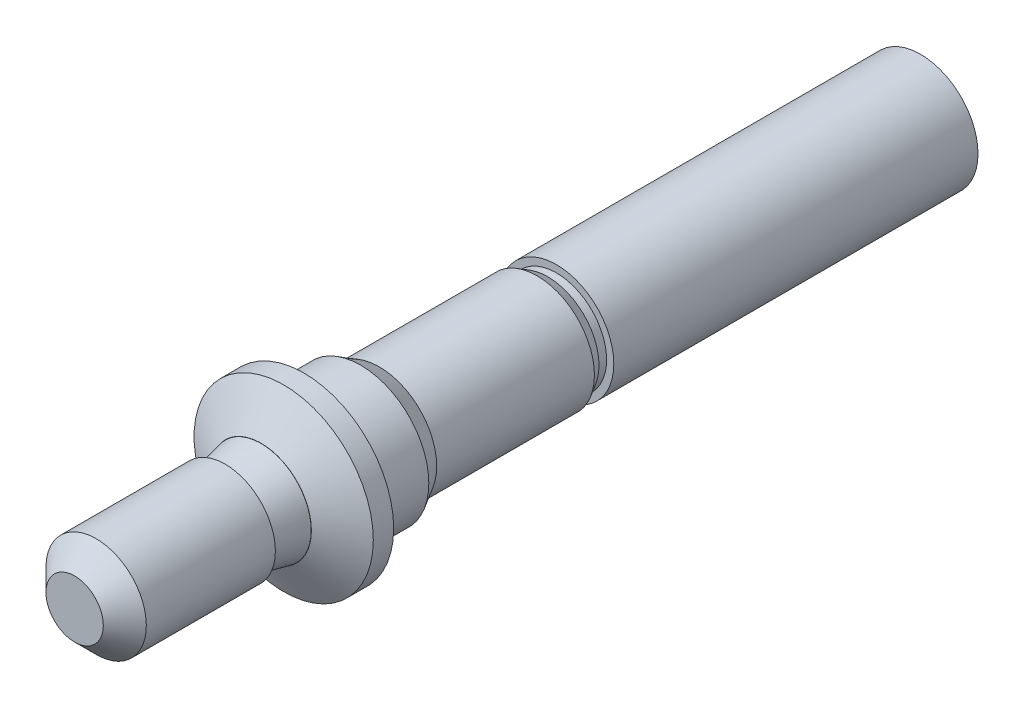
ISO-10303-21;
HEADER;
FILE_DESCRIPTION(('STEP AP214'),'2;1');
FILE_NAME('part.step','',(''),(''),'','','');
FILE_SCHEMA(('AUTOMOTIVE_DESIGN { 1 0 10303 214 1 1 1 1 }'));
ENDSEC;
DATA;
#1=APPLICATION_CONTEXT('core data for automotive mechanical design processes');
#2=APPLICATION_PROTOCOL_DEFINITION('international standard','automotive_design',2000,#1);
#3=PRODUCT_CONTEXT('',#1,'mechanical');
#4=PRODUCT('Part','Part','',(#3));
#5=PRODUCT_RELATED_PRODUCT_CATEGORY('part','',(#4));
#6=PRODUCT_DEFINITION_FORMATION('','',#4);
#7=PRODUCT_DEFINITION_CONTEXT('part definition',#1,'design');
#8=PRODUCT_DEFINITION('design','',#6,#7);
#9=PRODUCT_DEFINITION_SHAPE('','',#8);
#10=(LENGTH_UNIT() NAMED_UNIT(*) SI_UNIT(.MILLI.,.METRE.));
#11=(NAMED_UNIT(*) PLANE_ANGLE_UNIT() SI_UNIT($,.RADIAN.));
#12=(NAMED_UNIT(*) SI_UNIT($,.STERADIAN.) SOLID_ANGLE_UNIT());
#13=UNCERTAINTY_MEASURE_WITH_UNIT(LENGTH_MEASURE(1.E-05),#10,'distance_accuracy_value','');
#14=(GEOMETRIC_REPRESENTATION_CONTEXT(3) GLOBAL_UNCERTAINTY_ASSIGNED_CONTEXT((#13)) GLOBAL_UNIT_ASSIGNED_CONTEXT((#10,
#11,#12)) REPRESENTATION_CONTEXT('',''));
#15=CARTESIAN_POINT('',(0.,0.,0.));
#16=DIRECTION('',(0.,0.,1.));
#17=DIRECTION('',(1.,0.,0.));
#18=AXIS2_PLACEMENT_3D('',#15,#16,#17);
#19=CARTESIAN_POINT('',(0.,0.,130.));
#20=DIRECTION('',(0.,0.,1.));
#21=DIRECTION('',(1.,0.,0.));
#22=AXIS2_PLACEMENT_3D('',#19,#20,#21);
#23=CYLINDRICAL_SURFACE('',#22,8.);
#24=CARTESIAN_POINT('',(0.,0.,53.5));
#25=DIRECTION('',(0.,0.,-1.));
#26=DIRECTION('',(-1.,0.,0.));
#27=AXIS2_PLACEMENT_3D('',#24,#25,#26);
#28=CIRCLE('',#27,8.);
#29=CARTESIAN_POINT('',(-8.,0.,53.5));
#30=VERTEX_POINT('',#29);
#31=EDGE_CURVE('E10',#30,#30,#28,.F.);
#32=ORIENTED_EDGE('',*,*,#31,.T.);
#33=EDGE_LOOP('',(#32));
#34=FACE_BOUND('',#33,.T.);
#35=CARTESIAN_POINT('',(0.,0.,75.5));
#36=DIRECTION('',(0.,0.,1.));
#37=DIRECTION('',(1.,0.,0.));
#38=AXIS2_PLACEMENT_3D('',#35,#36,#37);
#39=CIRCLE('',#38,8.00000000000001);
#40=CARTESIAN_POINT('',(8.00000000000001,0.,75.5));
#41=VERTEX_POINT('',#40);
#42=EDGE_CURVE('E66',#41,#41,#39,.T.);
#43=ORIENTED_EDGE('',*,*,#42,.F.);
#44=EDGE_LOOP('',(#43));
#45=FACE_BOUND('',#44,.T.);
#46=ADVANCED_FACE('F24',(#34,#45),#23,.T.);
#47=CARTESIAN_POINT('',(0.,0.,118.));
#48=DIRECTION('',(0.,0.,-1.));
#49=DIRECTION('',(-1.,0.,0.));
#50=AXIS2_PLACEMENT_3D('',#47,#48,#49);
#51=CYLINDRICAL_SURFACE('',#50,12.5);
#52=CARTESIAN_POINT('',(0.,0.,88.84));
#53=DIRECTION('',(0.,0.,1.));
#54=DIRECTION('',(1.,0.,0.));
#55=AXIS2_PLACEMENT_3D('',#52,#53,#54);
#56=CIRCLE('',#55,12.5);
#57=CARTESIAN_POINT('',(12.5,0.,88.84));
#58=VERTEX_POINT('',#57);
#59=EDGE_CURVE('E49',#58,#58,#56,.F.);
#60=ORIENTED_EDGE('',*,*,#59,.T.);
#61=EDGE_LOOP('',(#60));
#62=FACE_BOUND('',#61,.T.);
#63=CARTESIAN_POINT('',(0.,0.,86.));
#64=DIRECTION('',(0.,0.,1.));
#65=DIRECTION('',(1.,0.,0.));
#66=AXIS2_PLACEMENT_3D('',#63,#64,#65);
#67=CIRCLE('',#66,12.5);
#68=CARTESIAN_POINT('',(12.5,0.,86.));
#69=VERTEX_POINT('',#68);
#70=EDGE_CURVE('E53',#69,#69,#67,.T.);
#71=ORIENTED_EDGE('',*,*,#70,.T.);
#72=EDGE_LOOP('',(#71));
#73=FACE_BOUND('',#72,.T.);
#74=ADVANCED_FACE('F26',(#62,#73),#51,.T.);
#75=CARTESIAN_POINT('',(0.,0.,128.434430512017));
#76=DIRECTION('',(0.,0.,1.));
#77=DIRECTION('',(1.,0.,0.));
#78=AXIS2_PLACEMENT_3D('',#75,#76,#77);
#79=CYLINDRICAL_SURFACE('',#78,9.5);
#80=CARTESIAN_POINT('',(0.,0.,78.0980762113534));
#81=DIRECTION('',(0.,0.,-1.));
#82=DIRECTION('',(-1.,0.,0.));
#83=AXIS2_PLACEMENT_3D('',#80,#81,#82);
#84=CIRCLE('',#83,9.5);
#85=CARTESIAN_POINT('',(-9.5,0.,78.0980762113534));
#86=VERTEX_POINT('',#85);
#87=EDGE_CURVE('E60',#86,#86,#84,.F.);
#88=ORIENTED_EDGE('',*,*,#87,.T.);
#89=EDGE_LOOP('',(#88));
#90=FACE_BOUND('',#89,.T.);
#91=CARTESIAN_POINT('',(0.,0.,86.));
#92=DIRECTION('',(0.,0.,1.));
#93=DIRECTION('',(1.,0.,0.));
#94=AXIS2_PLACEMENT_3D('',#91,#92,#93);
#95=CIRCLE('',#94,9.5);
#96=CARTESIAN_POINT('',(9.5,0.,86.));
#97=VERTEX_POINT('',#96);
#98=EDGE_CURVE('E69',#97,#97,#95,.T.);
#99=ORIENTED_EDGE('',*,*,#98,.F.);
#100=EDGE_LOOP('',(#99));
#101=FACE_BOUND('',#100,.T.);
#102=ADVANCED_FACE('F120',(#90,#101),#79,.T.);
#103=CARTESIAN_POINT('',(0.,-12.5,86.));
#104=DIRECTION('',(0.,0.,-1.));
#105=DIRECTION('',(-1.,0.,0.));
#106=AXIS2_PLACEMENT_3D('',#103,#104,#105);
#107=PLANE('',#106);
#108=ORIENTED_EDGE('',*,*,#98,.T.);
#109=EDGE_LOOP('',(#108));
#110=FACE_BOUND('',#109,.T.);
#111=ORIENTED_EDGE('',*,*,#70,.F.);
#112=EDGE_LOOP('',(#111));
#113=FACE_BOUND('',#112,.T.);
#114=ADVANCED_FACE('F129',(#110,#113),#107,.T.);
#115=CARTESIAN_POINT('',(0.,0.,78.0980762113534));
#116=DIRECTION('',(0.,0.,1.));
#117=DIRECTION('',(1.,0.,0.));
#118=AXIS2_PLACEMENT_3D('',#115,#116,#117);
#119=CONICAL_SURFACE('',#118,9.5,0.523598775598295);
#120=ORIENTED_EDGE('',*,*,#42,.T.);
#121=EDGE_LOOP('',(#120));
#122=FACE_BOUND('',#121,.T.);
#123=ORIENTED_EDGE('',*,*,#87,.F.);
#124=EDGE_LOOP('',(#123));
#125=FACE_BOUND('',#124,.T.);
#126=ADVANCED_FACE('F125',(#122,#125),#119,.T.);
#127=CARTESIAN_POINT('',(0.,-7.,92.));
#128=DIRECTION('',(0.,0.,1.));
#129=DIRECTION('',(1.,0.,0.));
#130=AXIS2_PLACEMENT_3D('',#127,#128,#129);
#131=PLANE('',#130);
#132=CARTESIAN_POINT('',(0.,0.,92.));
#133=DIRECTION('',(0.,0.,1.));
#134=DIRECTION('',(1.,0.,0.));
#135=AXIS2_PLACEMENT_3D('',#132,#133,#134);
#136=CIRCLE('',#135,7.02671944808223);
#137=CARTESIAN_POINT('',(7.02671944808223,0.,92.));
#138=VERTEX_POINT('',#137);
#139=EDGE_CURVE('E57',#138,#138,#136,.T.);
#140=ORIENTED_EDGE('',*,*,#139,.T.);
#141=EDGE_LOOP('',(#140));
#142=FACE_BOUND('',#141,.T.);
#143=CARTESIAN_POINT('',(0.,0.,92.));
#144=DIRECTION('',(0.,0.,1.));
#145=DIRECTION('',(1.,0.,0.));
#146=AXIS2_PLACEMENT_3D('',#143,#144,#145);
#147=CIRCLE('',#146,7.);
#148=CARTESIAN_POINT('',(7.,0.,92.));
#149=VERTEX_POINT('',#148);
#150=EDGE_CURVE('E54',#149,#149,#147,.T.);
#151=ORIENTED_EDGE('',*,*,#150,.F.);
#152=EDGE_LOOP('',(#151));
#153=FACE_BOUND('',#152,.T.);
#154=ADVANCED_FACE('F128',(#142,#153),#131,.T.);
#155=CARTESIAN_POINT('',(0.,0.,92.));
#156=DIRECTION('',(0.,0.,-1.));
#157=DIRECTION('',(-1.,0.,0.));
#158=AXIS2_PLACEMENT_3D('',#155,#156,#157);
#159=CONICAL_SURFACE('',#158,7.02671944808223,1.0471975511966);
#160=ORIENTED_EDGE('',*,*,#59,.F.);
#161=EDGE_LOOP('',(#160));
#162=FACE_BOUND('',#161,.T.);
#163=ORIENTED_EDGE('',*,*,#139,.F.);
#164=EDGE_LOOP('',(#163));
#165=FACE_BOUND('',#164,.T.);
#166=ADVANCED_FACE('F147',(#162,#165),#159,.T.);
#167=CARTESIAN_POINT('',(0.,5.92,97.));
#168=DIRECTION('',(0.,0.,1.));
#169=DIRECTION('',(1.,0.,0.));
#170=AXIS2_PLACEMENT_3D('',#167,#168,#169);
#171=PLANE('',#170);
#172=CARTESIAN_POINT('',(0.,0.,97.));
#173=DIRECTION('',(0.,0.,1.));
#174=DIRECTION('',(1.,0.,0.));
#175=AXIS2_PLACEMENT_3D('',#172,#173,#174);
#176=CIRCLE('',#175,5.92);
#177=CARTESIAN_POINT('',(5.92,0.,97.));
#178=VERTEX_POINT('',#177);
#179=EDGE_CURVE('E44',#178,#178,#176,.T.);
#180=ORIENTED_EDGE('',*,*,#179,.T.);
#181=EDGE_LOOP('',(#180));
#182=FACE_BOUND('',#181,.T.);
#183=CARTESIAN_POINT('',(0.,0.,97.));
#184=DIRECTION('',(0.,0.,1.));
#185=DIRECTION('',(1.,0.,0.));
#186=AXIS2_PLACEMENT_3D('',#183,#184,#185);
#187=CIRCLE('',#186,7.);
#188=CARTESIAN_POINT('',(7.,0.,97.));
#189=VERTEX_POINT('',#188);
#190=EDGE_CURVE('E50',#189,#189,#187,.T.);
#191=ORIENTED_EDGE('',*,*,#190,.F.);
#192=EDGE_LOOP('',(#191));
#193=FACE_BOUND('',#192,.T.);
#194=ADVANCED_FACE('F156',(#182,#193),#171,.F.);
#195=CARTESIAN_POINT('',(0.,0.,92.));
#196=DIRECTION('',(0.,0.,-1.));
#197=DIRECTION('',(-1.,0.,0.));
#198=AXIS2_PLACEMENT_3D('',#195,#196,#197);
#199=CONICAL_SURFACE('',#198,7.,0.21273178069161);
#200=ORIENTED_EDGE('',*,*,#179,.F.);
#201=EDGE_LOOP('',(#200));
#202=FACE_BOUND('',#201,.T.);
#203=ORIENTED_EDGE('',*,*,#150,.T.);
#204=EDGE_LOOP('',(#203));
#205=FACE_BOUND('',#204,.T.);
#206=ADVANCED_FACE('F158',(#202,#205),#199,.T.);
#207=CARTESIAN_POINT('',(0.,0.,118.));
#208=DIRECTION('',(0.,0.,1.));
#209=DIRECTION('',(1.,0.,0.));
#210=AXIS2_PLACEMENT_3D('',#207,#208,#209);
#211=PLANE('',#210);
#212=CARTESIAN_POINT('',(0.,0.,118.));
#213=DIRECTION('',(0.,0.,1.));
#214=DIRECTION('',(1.,0.,0.));
#215=AXIS2_PLACEMENT_3D('',#212,#213,#214);
#216=CIRCLE('',#215,3.99999999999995);
#217=CARTESIAN_POINT('',(3.99999999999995,0.,118.));
#218=VERTEX_POINT('',#217);
#219=EDGE_CURVE('E39',#218,#218,#216,.T.);
#220=ORIENTED_EDGE('',*,*,#219,.T.);
#221=EDGE_LOOP('',(#220));
#222=FACE_BOUND('',#221,.T.);
#223=ADVANCED_FACE('F152',(#222),#211,.T.);
#224=CARTESIAN_POINT('',(0.,0.,121.876732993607));
#225=DIRECTION('',(0.,0.,1.));
#226=DIRECTION('',(1.,0.,0.));
#227=AXIS2_PLACEMENT_3D('',#224,#225,#226);
#228=CYLINDRICAL_SURFACE('',#227,7.);
#229=CARTESIAN_POINT('',(0.,0.,115.));
#230=DIRECTION('',(0.,0.,1.));
#231=DIRECTION('',(1.,0.,0.));
#232=AXIS2_PLACEMENT_3D('',#229,#230,#231);
#233=CIRCLE('',#232,7.);
#234=CARTESIAN_POINT('',(7.,0.,115.));
#235=VERTEX_POINT('',#234);
#236=EDGE_CURVE('E35',#235,#235,#233,.F.);
#237=ORIENTED_EDGE('',*,*,#236,.T.);
#238=EDGE_LOOP('',(#237));
#239=FACE_BOUND('',#238,.T.);
#240=ORIENTED_EDGE('',*,*,#190,.T.);
#241=EDGE_LOOP('',(#240));
#242=FACE_BOUND('',#241,.T.);
#243=ADVANCED_FACE('F149',(#239,#242),#228,.T.);
#244=CARTESIAN_POINT('',(0.,0.,118.));
#245=DIRECTION('',(0.,0.,-1.));
#246=DIRECTION('',(-1.,0.,0.));
#247=AXIS2_PLACEMENT_3D('',#244,#245,#246);
#248=CONICAL_SURFACE('',#247,3.99999999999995,0.785398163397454);
#249=ORIENTED_EDGE('',*,*,#236,.F.);
#250=EDGE_LOOP('',(#249));
#251=FACE_BOUND('',#250,.T.);
#252=ORIENTED_EDGE('',*,*,#219,.F.);
#253=EDGE_LOOP('',(#252));
#254=FACE_BOUND('',#253,.T.);
#255=ADVANCED_FACE('F96',(#251,#254),#248,.T.);
#256=CARTESIAN_POINT('',(0.,-7.,50.8));
#257=DIRECTION('',(0.,0.,1.));
#258=DIRECTION('',(1.,0.,0.));
#259=AXIS2_PLACEMENT_3D('',#256,#257,#258);
#260=PLANE('',#259);
#261=CARTESIAN_POINT('',(0.,0.,50.8));
#262=DIRECTION('',(0.,0.,1.));
#263=DIRECTION('',(1.,0.,0.));
#264=AXIS2_PLACEMENT_3D('',#261,#262,#263);
#265=CIRCLE('',#264,7.);
#266=CARTESIAN_POINT('',(7.,0.,50.8));
#267=VERTEX_POINT('',#266);
#268=EDGE_CURVE('E45',#267,#267,#265,.T.);
#269=ORIENTED_EDGE('',*,*,#268,.F.);
#270=EDGE_LOOP('',(#269));
#271=FACE_BOUND('',#270,.T.);
#272=CARTESIAN_POINT('',(0.,0.,50.8));
#273=DIRECTION('',(0.,0.,1.));
#274=DIRECTION('',(1.,0.,0.));
#275=AXIS2_PLACEMENT_3D('',#272,#273,#274);
#276=CIRCLE('',#275,8.);
#277=CARTESIAN_POINT('',(8.,0.,50.8));
#278=VERTEX_POINT('',#277);
#279=EDGE_CURVE('E42',#278,#278,#276,.T.);
#280=ORIENTED_EDGE('',*,*,#279,.T.);
#281=EDGE_LOOP('',(#280));
#282=FACE_BOUND('',#281,.T.);
#283=ADVANCED_FACE('F93',(#271,#282),#260,.T.);
#284=CARTESIAN_POINT('',(0.,-8.74876968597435,52.));
#285=DIRECTION('',(0.,0.,-1.));
#286=DIRECTION('',(-1.,0.,0.));
#287=AXIS2_PLACEMENT_3D('',#284,#285,#286);
#288=PLANE('',#287);
#289=CARTESIAN_POINT('',(0.,0.,52.));
#290=DIRECTION('',(0.,0.,-1.));
#291=DIRECTION('',(-1.,0.,0.));
#292=AXIS2_PLACEMENT_3D('',#289,#290,#291);
#293=CIRCLE('',#292,7.13397459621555);
#294=CARTESIAN_POINT('',(-7.13397459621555,0.,52.));
#295=VERTEX_POINT('',#294);
#296=EDGE_CURVE('E31',#295,#295,#293,.T.);
#297=ORIENTED_EDGE('',*,*,#296,.T.);
#298=EDGE_LOOP('',(#297));
#299=FACE_BOUND('',#298,.T.);
#300=CARTESIAN_POINT('',(0.,0.,52.));
#301=DIRECTION('',(0.,0.,1.));
#302=DIRECTION('',(1.,0.,0.));
#303=AXIS2_PLACEMENT_3D('',#300,#301,#302);
#304=CIRCLE('',#303,7.);
#305=CARTESIAN_POINT('',(7.,0.,52.));
#306=VERTEX_POINT('',#305);
#307=EDGE_CURVE('E80',#306,#306,#304,.T.);
#308=ORIENTED_EDGE('',*,*,#307,.T.);
#309=EDGE_LOOP('',(#308));
#310=FACE_BOUND('',#309,.T.);
#311=ADVANCED_FACE('F84',(#299,#310),#288,.T.);
#312=CARTESIAN_POINT('',(0.,0.,122.877229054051));
#313=DIRECTION('',(0.,0.,1.));
#314=DIRECTION('',(1.,0.,0.));
#315=AXIS2_PLACEMENT_3D('',#312,#313,#314);
#316=CYLINDRICAL_SURFACE('',#315,7.);
#317=ORIENTED_EDGE('',*,*,#307,.F.);
#318=EDGE_LOOP('',(#317));
#319=FACE_BOUND('',#318,.T.);
#320=ORIENTED_EDGE('',*,*,#268,.T.);
#321=EDGE_LOOP('',(#320));
#322=FACE_BOUND('',#321,.T.);
#323=ADVANCED_FACE('F86',(#319,#322),#316,.T.);
#324=CARTESIAN_POINT('',(0.,0.,0.));
#325=DIRECTION('',(0.,0.,1.));
#326=DIRECTION('',(1.,0.,0.));
#327=AXIS2_PLACEMENT_3D('',#324,#325,#326);
#328=PLANE('',#327);
#329=CARTESIAN_POINT('',(0.,0.,0.));
#330=DIRECTION('',(0.,0.,1.));
#331=DIRECTION('',(1.,0.,0.));
#332=AXIS2_PLACEMENT_3D('',#329,#330,#331);
#333=CIRCLE('',#332,8.);
#334=CARTESIAN_POINT('',(8.,0.,0.));
#335=VERTEX_POINT('',#334);
#336=EDGE_CURVE('E63',#335,#335,#333,.F.);
#337=ORIENTED_EDGE('',*,*,#336,.T.);
#338=EDGE_LOOP('',(#337));
#339=FACE_BOUND('',#338,.T.);
#340=ADVANCED_FACE('F89',(#339),#328,.F.);
#341=ORIENTED_EDGE('',*,*,#336,.F.);
#342=EDGE_LOOP('',(#341));
#343=FACE_BOUND('',#342,.T.);
#344=ORIENTED_EDGE('',*,*,#279,.F.);
#345=EDGE_LOOP('',(#344));
#346=FACE_BOUND('',#345,.T.);
#347=ADVANCED_FACE('F100',(#343,#346),#23,.T.);
#348=CARTESIAN_POINT('',(0.,0.,52.));
#349=DIRECTION('',(0.,0.,1.));
#350=DIRECTION('',(1.,0.,0.));
#351=AXIS2_PLACEMENT_3D('',#348,#349,#350);
#352=CONICAL_SURFACE('',#351,7.13397459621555,0.523598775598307);
#353=ORIENTED_EDGE('',*,*,#31,.F.);
#354=EDGE_LOOP('',(#353));
#355=FACE_BOUND('',#354,.T.);
#356=ORIENTED_EDGE('',*,*,#296,.F.);
#357=EDGE_LOOP('',(#356));
#358=FACE_BOUND('',#357,.T.);
#359=ADVANCED_FACE('F102',(#355,#358),#352,.T.);
#360=CLOSED_SHELL('',(#46,#74,#102,#114,#126,#154,#166,#194,#206,#223,#243,#255,#283,#311,#323,
#340,#347,#359));
#361=MANIFOLD_SOLID_BREP('B2',#360);
#362=ADVANCED_BREP_SHAPE_REPRESENTATION('',(#18,#361),#14);
#363=SHAPE_DEFINITION_REPRESENTATION(#9,#362);
ENDSEC;
END-ISO-10303-21;
